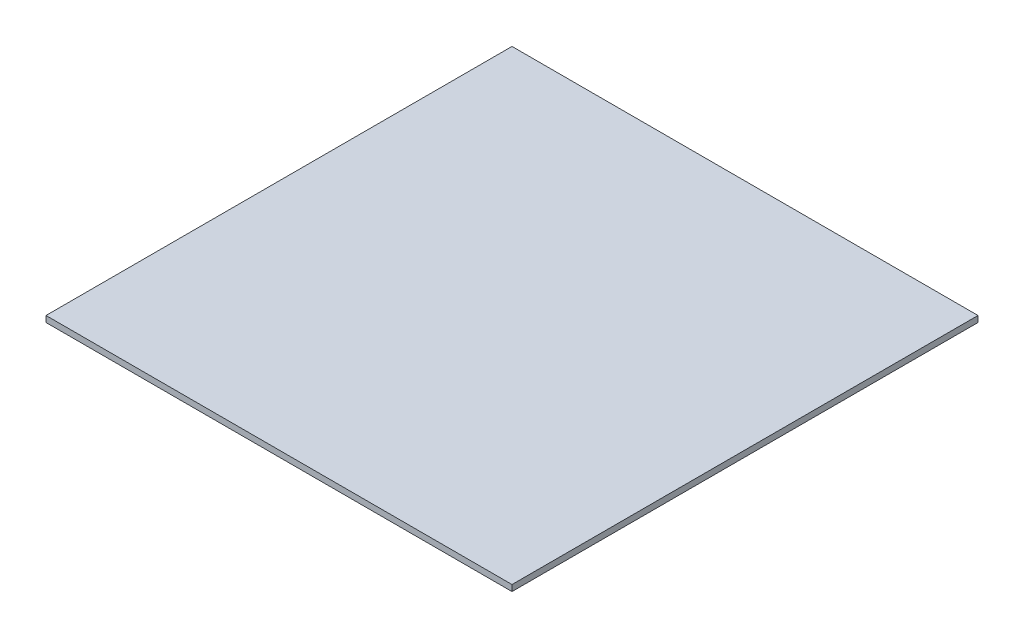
ISO-10303-21;
HEADER;
FILE_DESCRIPTION(('STEP AP214'),'2;1');
FILE_NAME('part.step','',(''),(''),'','','');
FILE_SCHEMA(('AUTOMOTIVE_DESIGN { 1 0 10303 214 1 1 1 1 }'));
ENDSEC;
DATA;
#1=APPLICATION_CONTEXT('core data for automotive mechanical design processes');
#2=APPLICATION_PROTOCOL_DEFINITION('international standard','automotive_design',2000,#1);
#3=PRODUCT_CONTEXT('',#1,'mechanical');
#4=PRODUCT('Part','Part','',(#3));
#5=PRODUCT_RELATED_PRODUCT_CATEGORY('part','',(#4));
#6=PRODUCT_DEFINITION_FORMATION('','',#4);
#7=PRODUCT_DEFINITION_CONTEXT('part definition',#1,'design');
#8=PRODUCT_DEFINITION('design','',#6,#7);
#9=PRODUCT_DEFINITION_SHAPE('','',#8);
#10=(LENGTH_UNIT() NAMED_UNIT(*) SI_UNIT(.MILLI.,.METRE.));
#11=(NAMED_UNIT(*) PLANE_ANGLE_UNIT() SI_UNIT($,.RADIAN.));
#12=(NAMED_UNIT(*) SI_UNIT($,.STERADIAN.) SOLID_ANGLE_UNIT());
#13=UNCERTAINTY_MEASURE_WITH_UNIT(LENGTH_MEASURE(1.E-05),#10,'distance_accuracy_value','');
#14=(GEOMETRIC_REPRESENTATION_CONTEXT(3) GLOBAL_UNCERTAINTY_ASSIGNED_CONTEXT((#13)) GLOBAL_UNIT_ASSIGNED_CONTEXT((#10,
#11,#12)) REPRESENTATION_CONTEXT('',''));
#15=CARTESIAN_POINT('',(0.,0.,0.));
#16=DIRECTION('',(0.,0.,1.));
#17=DIRECTION('',(1.,0.,0.));
#18=AXIS2_PLACEMENT_3D('',#15,#16,#17);
#19=CARTESIAN_POINT('',(152.4,4.,152.4));
#20=DIRECTION('',(-1.,0.,0.));
#21=DIRECTION('',(0.,0.,1.));
#22=AXIS2_PLACEMENT_3D('',#19,#20,#21);
#23=PLANE('',#22);
#24=DIRECTION('',(0.,0.,-1.));
#25=VECTOR('',#24,1.);
#26=CARTESIAN_POINT('',(152.4,0.,152.4));
#27=LINE('',#26,#25);
#28=CARTESIAN_POINT('',(152.4,0.,152.4));
#29=VERTEX_POINT('',#28);
#30=CARTESIAN_POINT('',(152.4,0.,-152.4));
#31=VERTEX_POINT('',#30);
#32=EDGE_CURVE('E117',#29,#31,#27,.T.);
#33=ORIENTED_EDGE('',*,*,#32,.T.);
#34=DIRECTION('',(0.,-1.,0.));
#35=VECTOR('',#34,1.);
#36=CARTESIAN_POINT('',(152.4,4.,-152.4));
#37=LINE('',#36,#35);
#38=CARTESIAN_POINT('',(152.4,4.,-152.4));
#39=VERTEX_POINT('',#38);
#40=EDGE_CURVE('E11',#39,#31,#37,.T.);
#41=ORIENTED_EDGE('',*,*,#40,.F.);
#42=DIRECTION('',(0.,0.,-1.));
#43=VECTOR('',#42,1.);
#44=CARTESIAN_POINT('',(152.4,4.,152.4));
#45=LINE('',#44,#43);
#46=CARTESIAN_POINT('',(152.4,4.,152.4));
#47=VERTEX_POINT('',#46);
#48=EDGE_CURVE('E99',#47,#39,#45,.T.);
#49=ORIENTED_EDGE('',*,*,#48,.F.);
#50=DIRECTION('',(0.,-1.,0.));
#51=VECTOR('',#50,1.);
#52=CARTESIAN_POINT('',(152.4,4.,152.4));
#53=LINE('',#52,#51);
#54=EDGE_CURVE('E113',#47,#29,#53,.T.);
#55=ORIENTED_EDGE('',*,*,#54,.T.);
#56=EDGE_LOOP('',(#33,#41,#49,#55));
#57=FACE_BOUND('',#56,.T.);
#58=ADVANCED_FACE('F47',(#57),#23,.F.);
#59=CARTESIAN_POINT('',(-152.4,4.,-152.4));
#60=DIRECTION('',(0.,0.,1.));
#61=DIRECTION('',(1.,0.,0.));
#62=AXIS2_PLACEMENT_3D('',#59,#60,#61);
#63=PLANE('',#62);
#64=DIRECTION('',(-1.,0.,0.));
#65=VECTOR('',#64,1.);
#66=CARTESIAN_POINT('',(-152.4,0.,-152.4));
#67=LINE('',#66,#65);
#68=CARTESIAN_POINT('',(-152.4,0.,-152.4));
#69=VERTEX_POINT('',#68);
#70=EDGE_CURVE('E104',#31,#69,#67,.T.);
#71=ORIENTED_EDGE('',*,*,#70,.T.);
#72=DIRECTION('',(0.,-1.,0.));
#73=VECTOR('',#72,1.);
#74=CARTESIAN_POINT('',(-152.4,4.,-152.4));
#75=LINE('',#74,#73);
#76=CARTESIAN_POINT('',(-152.4,4.,-152.4));
#77=VERTEX_POINT('',#76);
#78=EDGE_CURVE('E56',#77,#69,#75,.T.);
#79=ORIENTED_EDGE('',*,*,#78,.F.);
#80=DIRECTION('',(-1.,0.,0.));
#81=VECTOR('',#80,1.);
#82=CARTESIAN_POINT('',(-152.4,4.,-152.4));
#83=LINE('',#82,#81);
#84=EDGE_CURVE('E94',#39,#77,#83,.T.);
#85=ORIENTED_EDGE('',*,*,#84,.F.);
#86=ORIENTED_EDGE('',*,*,#40,.T.);
#87=EDGE_LOOP('',(#71,#79,#85,#86));
#88=FACE_BOUND('',#87,.T.);
#89=ADVANCED_FACE('F103',(#88),#63,.F.);
#90=CARTESIAN_POINT('',(-152.4,4.,152.4));
#91=DIRECTION('',(1.,0.,0.));
#92=DIRECTION('',(0.,0.,-1.));
#93=AXIS2_PLACEMENT_3D('',#90,#91,#92);
#94=PLANE('',#93);
#95=DIRECTION('',(0.,0.,1.));
#96=VECTOR('',#95,1.);
#97=CARTESIAN_POINT('',(-152.4,0.,152.4));
#98=LINE('',#97,#96);
#99=CARTESIAN_POINT('',(-152.4,0.,152.4));
#100=VERTEX_POINT('',#99);
#101=EDGE_CURVE('E81',#69,#100,#98,.T.);
#102=ORIENTED_EDGE('',*,*,#101,.T.);
#103=DIRECTION('',(0.,-1.,0.));
#104=VECTOR('',#103,1.);
#105=CARTESIAN_POINT('',(-152.4,4.,152.4));
#106=LINE('',#105,#104);
#107=CARTESIAN_POINT('',(-152.4,4.,152.4));
#108=VERTEX_POINT('',#107);
#109=EDGE_CURVE('E106',#108,#100,#106,.T.);
#110=ORIENTED_EDGE('',*,*,#109,.F.);
#111=DIRECTION('',(0.,0.,1.));
#112=VECTOR('',#111,1.);
#113=CARTESIAN_POINT('',(-152.4,4.,152.4));
#114=LINE('',#113,#112);
#115=EDGE_CURVE('E97',#77,#108,#114,.T.);
#116=ORIENTED_EDGE('',*,*,#115,.F.);
#117=ORIENTED_EDGE('',*,*,#78,.T.);
#118=EDGE_LOOP('',(#102,#110,#116,#117));
#119=FACE_BOUND('',#118,.T.);
#120=ADVANCED_FACE('F107',(#119),#94,.F.);
#121=CARTESIAN_POINT('',(-152.4,4.,152.4));
#122=DIRECTION('',(0.,0.,-1.));
#123=DIRECTION('',(-1.,0.,0.));
#124=AXIS2_PLACEMENT_3D('',#121,#122,#123);
#125=PLANE('',#124);
#126=DIRECTION('',(1.,0.,0.));
#127=VECTOR('',#126,1.);
#128=CARTESIAN_POINT('',(-152.4,0.,152.4));
#129=LINE('',#128,#127);
#130=EDGE_CURVE('E87',#100,#29,#129,.T.);
#131=ORIENTED_EDGE('',*,*,#130,.T.);
#132=ORIENTED_EDGE('',*,*,#54,.F.);
#133=DIRECTION('',(1.,0.,0.));
#134=VECTOR('',#133,1.);
#135=CARTESIAN_POINT('',(-152.4,4.,152.4));
#136=LINE('',#135,#134);
#137=EDGE_CURVE('E64',#108,#47,#136,.T.);
#138=ORIENTED_EDGE('',*,*,#137,.F.);
#139=ORIENTED_EDGE('',*,*,#109,.T.);
#140=EDGE_LOOP('',(#131,#132,#138,#139));
#141=FACE_BOUND('',#140,.T.);
#142=ADVANCED_FACE('F132',(#141),#125,.F.);
#143=CARTESIAN_POINT('',(0.,4.,0.));
#144=DIRECTION('',(0.,-1.,0.));
#145=DIRECTION('',(0.,0.,-1.));
#146=AXIS2_PLACEMENT_3D('',#143,#144,#145);
#147=PLANE('',#146);
#148=ORIENTED_EDGE('',*,*,#48,.T.);
#149=ORIENTED_EDGE('',*,*,#84,.T.);
#150=ORIENTED_EDGE('',*,*,#115,.T.);
#151=ORIENTED_EDGE('',*,*,#137,.T.);
#152=EDGE_LOOP('',(#148,#149,#150,#151));
#153=FACE_BOUND('',#152,.T.);
#154=ADVANCED_FACE('F95',(#153),#147,.F.);
#155=CARTESIAN_POINT('',(0.,0.,0.));
#156=DIRECTION('',(0.,-1.,0.));
#157=DIRECTION('',(0.,0.,-1.));
#158=AXIS2_PLACEMENT_3D('',#155,#156,#157);
#159=PLANE('',#158);
#160=ORIENTED_EDGE('',*,*,#32,.F.);
#161=ORIENTED_EDGE('',*,*,#130,.F.);
#162=ORIENTED_EDGE('',*,*,#101,.F.);
#163=ORIENTED_EDGE('',*,*,#70,.F.);
#164=EDGE_LOOP('',(#160,#161,#162,#163));
#165=FACE_BOUND('',#164,.T.);
#166=ADVANCED_FACE('F135',(#165),#159,.T.);
#167=CLOSED_SHELL('',(#58,#89,#120,#142,#154,#166));
#168=MANIFOLD_SOLID_BREP('B2',#167);
#169=ADVANCED_BREP_SHAPE_REPRESENTATION('',(#18,#168),#14);
#170=SHAPE_DEFINITION_REPRESENTATION(#9,#169);
ENDSEC;
END-ISO-10303-21;
